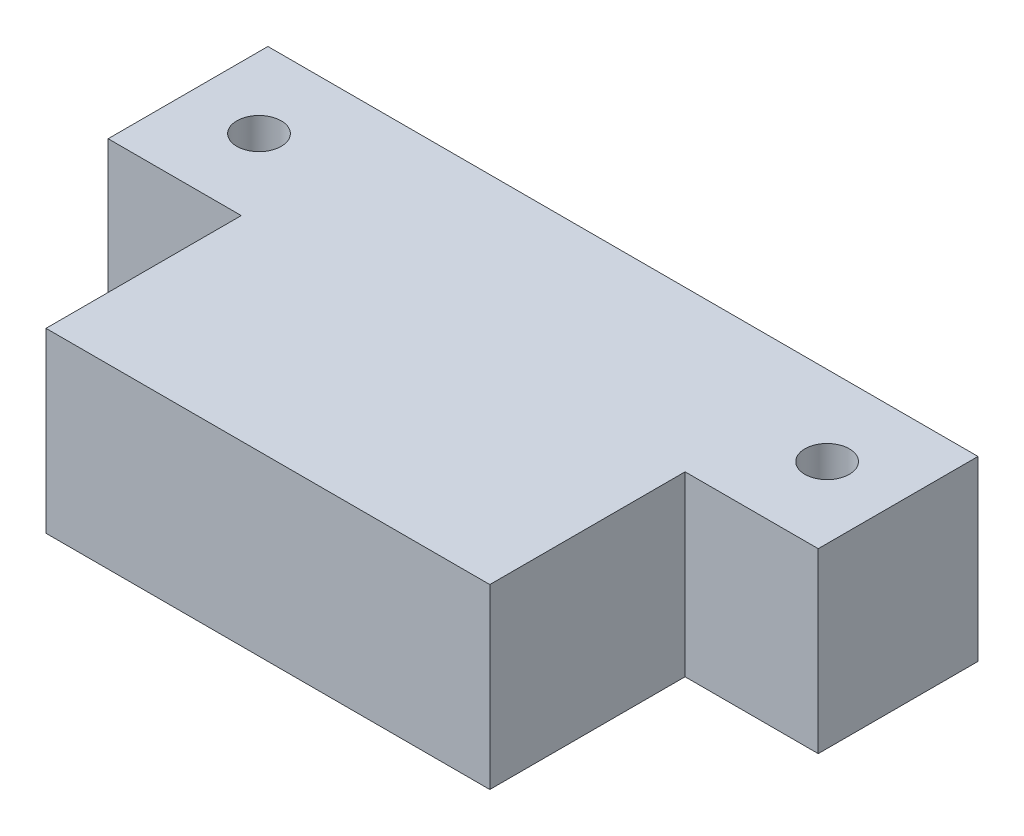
ISO-10303-21;
HEADER;
FILE_DESCRIPTION(('STEP AP214'),'2;1');
FILE_NAME('part.step','',(''),(''),'','','');
FILE_SCHEMA(('AUTOMOTIVE_DESIGN { 1 0 10303 214 1 1 1 1 }'));
ENDSEC;
DATA;
#1=APPLICATION_CONTEXT('core data for automotive mechanical design processes');
#2=APPLICATION_PROTOCOL_DEFINITION('international standard','automotive_design',2000,#1);
#3=PRODUCT_CONTEXT('',#1,'mechanical');
#4=PRODUCT('Part','Part','',(#3));
#5=PRODUCT_RELATED_PRODUCT_CATEGORY('part','',(#4));
#6=PRODUCT_DEFINITION_FORMATION('','',#4);
#7=PRODUCT_DEFINITION_CONTEXT('part definition',#1,'design');
#8=PRODUCT_DEFINITION('design','',#6,#7);
#9=PRODUCT_DEFINITION_SHAPE('','',#8);
#10=(LENGTH_UNIT() NAMED_UNIT(*) SI_UNIT(.MILLI.,.METRE.));
#11=(NAMED_UNIT(*) PLANE_ANGLE_UNIT() SI_UNIT($,.RADIAN.));
#12=(NAMED_UNIT(*) SI_UNIT($,.STERADIAN.) SOLID_ANGLE_UNIT());
#13=UNCERTAINTY_MEASURE_WITH_UNIT(LENGTH_MEASURE(1.E-05),#10,'distance_accuracy_value','');
#14=(GEOMETRIC_REPRESENTATION_CONTEXT(3) GLOBAL_UNCERTAINTY_ASSIGNED_CONTEXT((#13)) GLOBAL_UNIT_ASSIGNED_CONTEXT((#10,
#11,#12)) REPRESENTATION_CONTEXT('',''));
#15=CARTESIAN_POINT('',(0.,0.,0.));
#16=DIRECTION('',(0.,0.,1.));
#17=DIRECTION('',(1.,0.,0.));
#18=AXIS2_PLACEMENT_3D('',#15,#16,#17);
#19=CARTESIAN_POINT('',(40.,20.,-2.));
#20=DIRECTION('',(-1.,0.,0.));
#21=DIRECTION('',(0.,0.,1.));
#22=AXIS2_PLACEMENT_3D('',#19,#20,#21);
#23=PLANE('',#22);
#24=DIRECTION('',(0.,0.,-1.));
#25=VECTOR('',#24,1.);
#26=CARTESIAN_POINT('',(40.,0.,-2.));
#27=LINE('',#26,#25);
#28=CARTESIAN_POINT('',(40.,0.,-2.));
#29=VERTEX_POINT('',#28);
#30=CARTESIAN_POINT('',(40.,0.,-20.));
#31=VERTEX_POINT('',#30);
#32=EDGE_CURVE('E139',#29,#31,#27,.T.);
#33=ORIENTED_EDGE('',*,*,#32,.T.);
#34=DIRECTION('',(0.,-1.,0.));
#35=VECTOR('',#34,1.);
#36=CARTESIAN_POINT('',(40.,20.,-20.));
#37=LINE('',#36,#35);
#38=CARTESIAN_POINT('',(40.,20.,-20.));
#39=VERTEX_POINT('',#38);
#40=EDGE_CURVE('E11',#39,#31,#37,.T.);
#41=ORIENTED_EDGE('',*,*,#40,.F.);
#42=DIRECTION('',(0.,0.,-1.));
#43=VECTOR('',#42,1.);
#44=CARTESIAN_POINT('',(40.,20.,-2.));
#45=LINE('',#44,#43);
#46=CARTESIAN_POINT('',(40.,20.,-2.));
#47=VERTEX_POINT('',#46);
#48=EDGE_CURVE('E154',#47,#39,#45,.T.);
#49=ORIENTED_EDGE('',*,*,#48,.F.);
#50=DIRECTION('',(0.,-1.,0.));
#51=VECTOR('',#50,1.);
#52=CARTESIAN_POINT('',(40.,20.,-2.));
#53=LINE('',#52,#51);
#54=EDGE_CURVE('E135',#47,#29,#53,.T.);
#55=ORIENTED_EDGE('',*,*,#54,.T.);
#56=EDGE_LOOP('',(#33,#41,#49,#55));
#57=FACE_BOUND('',#56,.T.);
#58=ADVANCED_FACE('F43',(#57),#23,.F.);
#59=CARTESIAN_POINT('',(-40.,20.,-20.));
#60=DIRECTION('',(0.,0.,1.));
#61=DIRECTION('',(1.,0.,0.));
#62=AXIS2_PLACEMENT_3D('',#59,#60,#61);
#63=PLANE('',#62);
#64=DIRECTION('',(-1.,0.,0.));
#65=VECTOR('',#64,1.);
#66=CARTESIAN_POINT('',(-40.,0.,-20.));
#67=LINE('',#66,#65);
#68=CARTESIAN_POINT('',(-40.,0.,-20.));
#69=VERTEX_POINT('',#68);
#70=EDGE_CURVE('E142',#31,#69,#67,.T.);
#71=ORIENTED_EDGE('',*,*,#70,.T.);
#72=DIRECTION('',(0.,-1.,0.));
#73=VECTOR('',#72,1.);
#74=CARTESIAN_POINT('',(-40.,20.,-20.));
#75=LINE('',#74,#73);
#76=CARTESIAN_POINT('',(-40.,20.,-20.));
#77=VERTEX_POINT('',#76);
#78=EDGE_CURVE('E51',#77,#69,#75,.T.);
#79=ORIENTED_EDGE('',*,*,#78,.F.);
#80=DIRECTION('',(-1.,0.,0.));
#81=VECTOR('',#80,1.);
#82=CARTESIAN_POINT('',(-40.,20.,-20.));
#83=LINE('',#82,#81);
#84=EDGE_CURVE('E102',#39,#77,#83,.T.);
#85=ORIENTED_EDGE('',*,*,#84,.F.);
#86=ORIENTED_EDGE('',*,*,#40,.T.);
#87=EDGE_LOOP('',(#71,#79,#85,#86));
#88=FACE_BOUND('',#87,.T.);
#89=ADVANCED_FACE('F224',(#88),#63,.F.);
#90=CARTESIAN_POINT('',(-40.,20.,-1.99999999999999));
#91=DIRECTION('',(1.,0.,0.));
#92=DIRECTION('',(0.,0.,-1.));
#93=AXIS2_PLACEMENT_3D('',#90,#91,#92);
#94=PLANE('',#93);
#95=DIRECTION('',(0.,0.,1.));
#96=VECTOR('',#95,1.);
#97=CARTESIAN_POINT('',(-40.,0.,-1.99999999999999));
#98=LINE('',#97,#96);
#99=CARTESIAN_POINT('',(-40.,0.,-1.99999999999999));
#100=VERTEX_POINT('',#99);
#101=EDGE_CURVE('E145',#69,#100,#98,.T.);
#102=ORIENTED_EDGE('',*,*,#101,.T.);
#103=DIRECTION('',(0.,-1.,0.));
#104=VECTOR('',#103,1.);
#105=CARTESIAN_POINT('',(-40.,20.,-1.99999999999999));
#106=LINE('',#105,#104);
#107=CARTESIAN_POINT('',(-40.,20.,-1.99999999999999));
#108=VERTEX_POINT('',#107);
#109=EDGE_CURVE('E161',#108,#100,#106,.T.);
#110=ORIENTED_EDGE('',*,*,#109,.F.);
#111=DIRECTION('',(0.,0.,1.));
#112=VECTOR('',#111,1.);
#113=CARTESIAN_POINT('',(-40.,20.,-1.99999999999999));
#114=LINE('',#113,#112);
#115=EDGE_CURVE('E169',#77,#108,#114,.T.);
#116=ORIENTED_EDGE('',*,*,#115,.F.);
#117=ORIENTED_EDGE('',*,*,#78,.T.);
#118=EDGE_LOOP('',(#102,#110,#116,#117));
#119=FACE_BOUND('',#118,.T.);
#120=ADVANCED_FACE('F167',(#119),#94,.F.);
#121=CARTESIAN_POINT('',(-25.,20.,-1.99999999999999));
#122=DIRECTION('',(0.,0.,-1.));
#123=DIRECTION('',(-1.,0.,0.));
#124=AXIS2_PLACEMENT_3D('',#121,#122,#123);
#125=PLANE('',#124);
#126=DIRECTION('',(1.,0.,0.));
#127=VECTOR('',#126,1.);
#128=CARTESIAN_POINT('',(-25.,0.,-1.99999999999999));
#129=LINE('',#128,#127);
#130=CARTESIAN_POINT('',(-25.,0.,-1.99999999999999));
#131=VERTEX_POINT('',#130);
#132=EDGE_CURVE('E147',#100,#131,#129,.T.);
#133=ORIENTED_EDGE('',*,*,#132,.T.);
#134=DIRECTION('',(0.,-1.,0.));
#135=VECTOR('',#134,1.);
#136=CARTESIAN_POINT('',(-25.,20.,-1.99999999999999));
#137=LINE('',#136,#135);
#138=CARTESIAN_POINT('',(-25.,20.,-1.99999999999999));
#139=VERTEX_POINT('',#138);
#140=EDGE_CURVE('E158',#139,#131,#137,.T.);
#141=ORIENTED_EDGE('',*,*,#140,.F.);
#142=DIRECTION('',(1.,0.,0.));
#143=VECTOR('',#142,1.);
#144=CARTESIAN_POINT('',(-25.,20.,-1.99999999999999));
#145=LINE('',#144,#143);
#146=EDGE_CURVE('E181',#108,#139,#145,.T.);
#147=ORIENTED_EDGE('',*,*,#146,.F.);
#148=ORIENTED_EDGE('',*,*,#109,.T.);
#149=EDGE_LOOP('',(#133,#141,#147,#148));
#150=FACE_BOUND('',#149,.T.);
#151=ADVANCED_FACE('F177',(#150),#125,.F.);
#152=CARTESIAN_POINT('',(-25.,20.,20.));
#153=DIRECTION('',(1.,0.,0.));
#154=DIRECTION('',(0.,0.,-1.));
#155=AXIS2_PLACEMENT_3D('',#152,#153,#154);
#156=PLANE('',#155);
#157=DIRECTION('',(0.,0.,1.));
#158=VECTOR('',#157,1.);
#159=CARTESIAN_POINT('',(-25.,0.,20.));
#160=LINE('',#159,#158);
#161=CARTESIAN_POINT('',(-25.,0.,20.));
#162=VERTEX_POINT('',#161);
#163=EDGE_CURVE('E149',#131,#162,#160,.T.);
#164=ORIENTED_EDGE('',*,*,#163,.T.);
#165=DIRECTION('',(0.,-1.,0.));
#166=VECTOR('',#165,1.);
#167=CARTESIAN_POINT('',(-25.,20.,20.));
#168=LINE('',#167,#166);
#169=CARTESIAN_POINT('',(-25.,20.,20.));
#170=VERTEX_POINT('',#169);
#171=EDGE_CURVE('E130',#170,#162,#168,.T.);
#172=ORIENTED_EDGE('',*,*,#171,.F.);
#173=DIRECTION('',(0.,0.,1.));
#174=VECTOR('',#173,1.);
#175=CARTESIAN_POINT('',(-25.,20.,20.));
#176=LINE('',#175,#174);
#177=EDGE_CURVE('E121',#139,#170,#176,.T.);
#178=ORIENTED_EDGE('',*,*,#177,.F.);
#179=ORIENTED_EDGE('',*,*,#140,.T.);
#180=EDGE_LOOP('',(#164,#172,#178,#179));
#181=FACE_BOUND('',#180,.T.);
#182=ADVANCED_FACE('F180',(#181),#156,.F.);
#183=CARTESIAN_POINT('',(-25.,20.,20.));
#184=DIRECTION('',(0.,0.,-1.));
#185=DIRECTION('',(-1.,0.,0.));
#186=AXIS2_PLACEMENT_3D('',#183,#184,#185);
#187=PLANE('',#186);
#188=DIRECTION('',(1.,0.,0.));
#189=VECTOR('',#188,1.);
#190=CARTESIAN_POINT('',(-25.,0.,20.));
#191=LINE('',#190,#189);
#192=CARTESIAN_POINT('',(25.,0.,20.));
#193=VERTEX_POINT('',#192);
#194=EDGE_CURVE('E129',#162,#193,#191,.T.);
#195=ORIENTED_EDGE('',*,*,#194,.T.);
#196=DIRECTION('',(0.,-1.,0.));
#197=VECTOR('',#196,1.);
#198=CARTESIAN_POINT('',(25.,20.,20.));
#199=LINE('',#198,#197);
#200=CARTESIAN_POINT('',(25.,20.,20.));
#201=VERTEX_POINT('',#200);
#202=EDGE_CURVE('E126',#201,#193,#199,.T.);
#203=ORIENTED_EDGE('',*,*,#202,.F.);
#204=DIRECTION('',(1.,0.,0.));
#205=VECTOR('',#204,1.);
#206=CARTESIAN_POINT('',(-25.,20.,20.));
#207=LINE('',#206,#205);
#208=EDGE_CURVE('E115',#170,#201,#207,.T.);
#209=ORIENTED_EDGE('',*,*,#208,.F.);
#210=ORIENTED_EDGE('',*,*,#171,.T.);
#211=EDGE_LOOP('',(#195,#203,#209,#210));
#212=FACE_BOUND('',#211,.T.);
#213=ADVANCED_FACE('F127',(#212),#187,.F.);
#214=CARTESIAN_POINT('',(25.,20.,20.));
#215=DIRECTION('',(-1.,0.,0.));
#216=DIRECTION('',(0.,0.,1.));
#217=AXIS2_PLACEMENT_3D('',#214,#215,#216);
#218=PLANE('',#217);
#219=DIRECTION('',(0.,0.,-1.));
#220=VECTOR('',#219,1.);
#221=CARTESIAN_POINT('',(25.,0.,20.));
#222=LINE('',#221,#220);
#223=CARTESIAN_POINT('',(25.0000000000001,0.,-2.));
#224=VERTEX_POINT('',#223);
#225=EDGE_CURVE('E88',#193,#224,#222,.T.);
#226=ORIENTED_EDGE('',*,*,#225,.T.);
#227=DIRECTION('',(0.,-1.,0.));
#228=VECTOR('',#227,1.);
#229=CARTESIAN_POINT('',(25.0000000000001,20.,-2.));
#230=LINE('',#229,#228);
#231=CARTESIAN_POINT('',(25.0000000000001,20.,-2.));
#232=VERTEX_POINT('',#231);
#233=EDGE_CURVE('E131',#232,#224,#230,.T.);
#234=ORIENTED_EDGE('',*,*,#233,.F.);
#235=DIRECTION('',(0.,0.,-1.));
#236=VECTOR('',#235,1.);
#237=CARTESIAN_POINT('',(25.,20.,20.));
#238=LINE('',#237,#236);
#239=EDGE_CURVE('E119',#201,#232,#238,.T.);
#240=ORIENTED_EDGE('',*,*,#239,.F.);
#241=ORIENTED_EDGE('',*,*,#202,.T.);
#242=EDGE_LOOP('',(#226,#234,#240,#241));
#243=FACE_BOUND('',#242,.T.);
#244=ADVANCED_FACE('F133',(#243),#218,.F.);
#245=CARTESIAN_POINT('',(25.0000000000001,20.,-2.));
#246=DIRECTION('',(0.,0.,-1.));
#247=DIRECTION('',(-1.,0.,0.));
#248=AXIS2_PLACEMENT_3D('',#245,#246,#247);
#249=PLANE('',#248);
#250=DIRECTION('',(1.,0.,0.));
#251=VECTOR('',#250,1.);
#252=CARTESIAN_POINT('',(25.0000000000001,0.,-2.));
#253=LINE('',#252,#251);
#254=EDGE_CURVE('E94',#224,#29,#253,.T.);
#255=ORIENTED_EDGE('',*,*,#254,.T.);
#256=ORIENTED_EDGE('',*,*,#54,.F.);
#257=DIRECTION('',(1.,0.,0.));
#258=VECTOR('',#257,1.);
#259=CARTESIAN_POINT('',(25.0000000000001,20.,-2.));
#260=LINE('',#259,#258);
#261=EDGE_CURVE('E59',#232,#47,#260,.T.);
#262=ORIENTED_EDGE('',*,*,#261,.F.);
#263=ORIENTED_EDGE('',*,*,#233,.T.);
#264=EDGE_LOOP('',(#255,#256,#262,#263));
#265=FACE_BOUND('',#264,.T.);
#266=ADVANCED_FACE('F210',(#265),#249,.F.);
#267=CARTESIAN_POINT('',(0.,20.,0.));
#268=DIRECTION('',(0.,-1.,0.));
#269=DIRECTION('',(0.,0.,-1.));
#270=AXIS2_PLACEMENT_3D('',#267,#268,#269);
#271=PLANE('',#270);
#272=CARTESIAN_POINT('',(32.,20.,-11.));
#273=DIRECTION('',(0.,1.,0.));
#274=DIRECTION('',(0.,0.,1.));
#275=AXIS2_PLACEMENT_3D('',#272,#273,#274);
#276=CIRCLE('',#275,2.5);
#277=CARTESIAN_POINT('',(32.,20.,-8.5));
#278=VERTEX_POINT('',#277);
#279=EDGE_CURVE('E193',#278,#278,#276,.T.);
#280=ORIENTED_EDGE('',*,*,#279,.F.);
#281=EDGE_LOOP('',(#280));
#282=FACE_BOUND('',#281,.T.);
#283=CARTESIAN_POINT('',(-32.,20.,-11.));
#284=DIRECTION('',(0.,1.,0.));
#285=DIRECTION('',(0.,0.,1.));
#286=AXIS2_PLACEMENT_3D('',#283,#284,#285);
#287=CIRCLE('',#286,2.5);
#288=CARTESIAN_POINT('',(-32.,20.,-8.5));
#289=VERTEX_POINT('',#288);
#290=EDGE_CURVE('E187',#289,#289,#287,.T.);
#291=ORIENTED_EDGE('',*,*,#290,.F.);
#292=EDGE_LOOP('',(#291));
#293=FACE_BOUND('',#292,.T.);
#294=ORIENTED_EDGE('',*,*,#48,.T.);
#295=ORIENTED_EDGE('',*,*,#84,.T.);
#296=ORIENTED_EDGE('',*,*,#115,.T.);
#297=ORIENTED_EDGE('',*,*,#146,.T.);
#298=ORIENTED_EDGE('',*,*,#177,.T.);
#299=ORIENTED_EDGE('',*,*,#208,.T.);
#300=ORIENTED_EDGE('',*,*,#239,.T.);
#301=ORIENTED_EDGE('',*,*,#261,.T.);
#302=EDGE_LOOP('',(#294,#295,#296,#297,#298,#299,#300,#301));
#303=FACE_BOUND('',#302,.T.);
#304=ADVANCED_FACE('F117',(#282,#293,#303),#271,.F.);
#305=CARTESIAN_POINT('',(0.,0.,0.));
#306=DIRECTION('',(0.,-1.,0.));
#307=DIRECTION('',(0.,0.,-1.));
#308=AXIS2_PLACEMENT_3D('',#305,#306,#307);
#309=PLANE('',#308);
#310=CARTESIAN_POINT('',(32.,0.,-11.));
#311=DIRECTION('',(0.,1.,0.));
#312=DIRECTION('',(0.,0.,1.));
#313=AXIS2_PLACEMENT_3D('',#310,#311,#312);
#314=CIRCLE('',#313,2.5);
#315=CARTESIAN_POINT('',(32.,0.,-8.5));
#316=VERTEX_POINT('',#315);
#317=EDGE_CURVE('E190',#316,#316,#314,.T.);
#318=ORIENTED_EDGE('',*,*,#317,.T.);
#319=EDGE_LOOP('',(#318));
#320=FACE_BOUND('',#319,.T.);
#321=CARTESIAN_POINT('',(-32.,0.,-11.));
#322=DIRECTION('',(0.,1.,0.));
#323=DIRECTION('',(0.,0.,1.));
#324=AXIS2_PLACEMENT_3D('',#321,#322,#323);
#325=CIRCLE('',#324,2.5);
#326=CARTESIAN_POINT('',(-32.,0.,-8.5));
#327=VERTEX_POINT('',#326);
#328=EDGE_CURVE('E143',#327,#327,#325,.T.);
#329=ORIENTED_EDGE('',*,*,#328,.T.);
#330=EDGE_LOOP('',(#329));
#331=FACE_BOUND('',#330,.T.);
#332=ORIENTED_EDGE('',*,*,#32,.F.);
#333=ORIENTED_EDGE('',*,*,#254,.F.);
#334=ORIENTED_EDGE('',*,*,#225,.F.);
#335=ORIENTED_EDGE('',*,*,#194,.F.);
#336=ORIENTED_EDGE('',*,*,#163,.F.);
#337=ORIENTED_EDGE('',*,*,#132,.F.);
#338=ORIENTED_EDGE('',*,*,#101,.F.);
#339=ORIENTED_EDGE('',*,*,#70,.F.);
#340=EDGE_LOOP('',(#332,#333,#334,#335,#336,#337,#338,#339));
#341=FACE_BOUND('',#340,.T.);
#342=ADVANCED_FACE('F173',(#320,#331,#341),#309,.T.);
#343=CARTESIAN_POINT('',(-32.,0.,-11.));
#344=DIRECTION('',(0.,1.,0.));
#345=DIRECTION('',(0.,0.,1.));
#346=AXIS2_PLACEMENT_3D('',#343,#344,#345);
#347=CYLINDRICAL_SURFACE('',#346,2.5);
#348=ORIENTED_EDGE('',*,*,#328,.F.);
#349=EDGE_LOOP('',(#348));
#350=FACE_BOUND('',#349,.T.);
#351=ORIENTED_EDGE('',*,*,#290,.T.);
#352=EDGE_LOOP('',(#351));
#353=FACE_BOUND('',#352,.T.);
#354=ADVANCED_FACE('F204',(#350,#353),#347,.F.);
#355=CARTESIAN_POINT('',(32.,0.,-11.));
#356=DIRECTION('',(0.,1.,0.));
#357=DIRECTION('',(0.,0.,1.));
#358=AXIS2_PLACEMENT_3D('',#355,#356,#357);
#359=CYLINDRICAL_SURFACE('',#358,2.5);
#360=ORIENTED_EDGE('',*,*,#317,.F.);
#361=EDGE_LOOP('',(#360));
#362=FACE_BOUND('',#361,.T.);
#363=ORIENTED_EDGE('',*,*,#279,.T.);
#364=EDGE_LOOP('',(#363));
#365=FACE_BOUND('',#364,.T.);
#366=ADVANCED_FACE('F201',(#362,#365),#359,.F.);
#367=CLOSED_SHELL('',(#58,#89,#120,#151,#182,#213,#244,#266,#304,#342,#354,#366));
#368=MANIFOLD_SOLID_BREP('B2',#367);
#369=ADVANCED_BREP_SHAPE_REPRESENTATION('',(#18,#368),#14);
#370=SHAPE_DEFINITION_REPRESENTATION(#9,#369);
ENDSEC;
END-ISO-10303-21;
